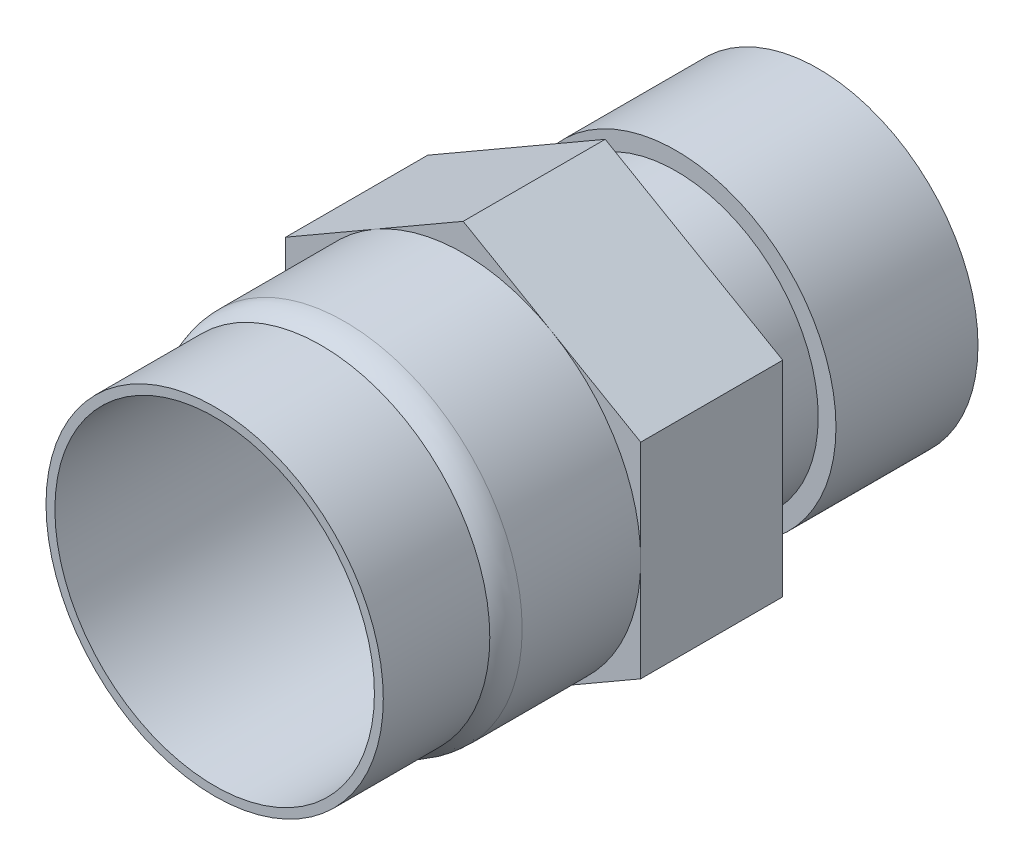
ISO-10303-21;
HEADER;
FILE_DESCRIPTION(('STEP AP214'),'2;1');
FILE_NAME('part.step','',(''),(''),'','','');
FILE_SCHEMA(('AUTOMOTIVE_DESIGN { 1 0 10303 214 1 1 1 1 }'));
ENDSEC;
DATA;
#1=APPLICATION_CONTEXT('core data for automotive mechanical design processes');
#2=APPLICATION_PROTOCOL_DEFINITION('international standard','automotive_design',2000,#1);
#3=PRODUCT_CONTEXT('',#1,'mechanical');
#4=PRODUCT('Part','Part','',(#3));
#5=PRODUCT_RELATED_PRODUCT_CATEGORY('part','',(#4));
#6=PRODUCT_DEFINITION_FORMATION('','',#4);
#7=PRODUCT_DEFINITION_CONTEXT('part definition',#1,'design');
#8=PRODUCT_DEFINITION('design','',#6,#7);
#9=PRODUCT_DEFINITION_SHAPE('','',#8);
#10=(LENGTH_UNIT() NAMED_UNIT(*) SI_UNIT(.MILLI.,.METRE.));
#11=(NAMED_UNIT(*) PLANE_ANGLE_UNIT() SI_UNIT($,.RADIAN.));
#12=(NAMED_UNIT(*) SI_UNIT($,.STERADIAN.) SOLID_ANGLE_UNIT());
#13=UNCERTAINTY_MEASURE_WITH_UNIT(LENGTH_MEASURE(1.E-05),#10,'distance_accuracy_value','');
#14=(GEOMETRIC_REPRESENTATION_CONTEXT(3) GLOBAL_UNCERTAINTY_ASSIGNED_CONTEXT((#13)) GLOBAL_UNIT_ASSIGNED_CONTEXT((#10,
#11,#12)) REPRESENTATION_CONTEXT('',''));
#15=CARTESIAN_POINT('',(0.,0.,0.));
#16=DIRECTION('',(0.,0.,1.));
#17=DIRECTION('',(1.,0.,0.));
#18=AXIS2_PLACEMENT_3D('',#15,#16,#17);
#19=CARTESIAN_POINT('',(-5.,2.88675134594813,-4.));
#20=DIRECTION('',(0.,0.,1.));
#21=DIRECTION('',(1.,0.,0.));
#22=AXIS2_PLACEMENT_3D('',#19,#20,#21);
#23=PLANE('',#22);
#24=CARTESIAN_POINT('',(0.,0.,-4.));
#25=DIRECTION('',(0.,0.,-1.));
#26=DIRECTION('',(-1.,0.,0.));
#27=AXIS2_PLACEMENT_3D('',#24,#25,#26);
#28=CIRCLE('',#27,4.75);
#29=CARTESIAN_POINT('',(-4.75,0.,-4.));
#30=VERTEX_POINT('',#29);
#31=EDGE_CURVE('E218',#30,#30,#28,.T.);
#32=ORIENTED_EDGE('',*,*,#31,.F.);
#33=EDGE_LOOP('',(#32));
#34=FACE_BOUND('',#33,.T.);
#35=DIRECTION('',(0.866025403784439,0.5,0.));
#36=VECTOR('',#35,1.);
#37=CARTESIAN_POINT('',(-5.,2.88675134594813,-4.));
#38=LINE('',#37,#36);
#39=CARTESIAN_POINT('',(-5.,2.88675134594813,-4.));
#40=VERTEX_POINT('',#39);
#41=CARTESIAN_POINT('',(0.,5.77350269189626,-4.));
#42=VERTEX_POINT('',#41);
#43=EDGE_CURVE('E116',#40,#42,#38,.T.);
#44=ORIENTED_EDGE('',*,*,#43,.T.);
#45=DIRECTION('',(0.866025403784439,-0.5,0.));
#46=VECTOR('',#45,1.);
#47=CARTESIAN_POINT('',(0.,5.77350269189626,-4.));
#48=LINE('',#47,#46);
#49=CARTESIAN_POINT('',(5.,2.88675134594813,-4.));
#50=VERTEX_POINT('',#49);
#51=EDGE_CURVE('E106',#42,#50,#48,.T.);
#52=ORIENTED_EDGE('',*,*,#51,.T.);
#53=DIRECTION('',(0.,-1.,0.));
#54=VECTOR('',#53,1.);
#55=CARTESIAN_POINT('',(5.,2.88675134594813,-4.));
#56=LINE('',#55,#54);
#57=CARTESIAN_POINT('',(5.,-2.88675134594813,-4.));
#58=VERTEX_POINT('',#57);
#59=EDGE_CURVE('E115',#50,#58,#56,.T.);
#60=ORIENTED_EDGE('',*,*,#59,.T.);
#61=DIRECTION('',(-0.866025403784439,-0.5,0.));
#62=VECTOR('',#61,1.);
#63=CARTESIAN_POINT('',(5.,-2.88675134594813,-4.));
#64=LINE('',#63,#62);
#65=CARTESIAN_POINT('',(0.,-5.77350269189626,-4.));
#66=VERTEX_POINT('',#65);
#67=EDGE_CURVE('E193',#58,#66,#64,.T.);
#68=ORIENTED_EDGE('',*,*,#67,.T.);
#69=DIRECTION('',(-0.866025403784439,0.5,0.));
#70=VECTOR('',#69,1.);
#71=CARTESIAN_POINT('',(0.,-5.77350269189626,-4.));
#72=LINE('',#71,#70);
#73=CARTESIAN_POINT('',(-5.,-2.88675134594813,-4.));
#74=VERTEX_POINT('',#73);
#75=EDGE_CURVE('E205',#66,#74,#72,.T.);
#76=ORIENTED_EDGE('',*,*,#75,.T.);
#77=DIRECTION('',(0.,1.,0.));
#78=VECTOR('',#77,1.);
#79=CARTESIAN_POINT('',(-5.,-2.88675134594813,-4.));
#80=LINE('',#79,#78);
#81=EDGE_CURVE('E120',#74,#40,#80,.T.);
#82=ORIENTED_EDGE('',*,*,#81,.T.);
#83=EDGE_LOOP('',(#44,#52,#60,#68,#76,#82));
#84=FACE_BOUND('',#83,.T.);
#85=ADVANCED_FACE('F31',(#34,#84),#23,.F.);
#86=CARTESIAN_POINT('',(0.,0.,4.));
#87=DIRECTION('',(0.,0.,-1.));
#88=DIRECTION('',(-1.,0.,0.));
#89=AXIS2_PLACEMENT_3D('',#86,#87,#88);
#90=CYLINDRICAL_SURFACE('',#89,5.);
#91=CARTESIAN_POINT('',(0.,0.,3.33856217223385));
#92=DIRECTION('',(0.,0.,1.));
#93=DIRECTION('',(1.,0.,0.));
#94=AXIS2_PLACEMENT_3D('',#91,#92,#93);
#95=CIRCLE('',#94,5.);
#96=CARTESIAN_POINT('',(5.,0.,3.33856217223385));
#97=VERTEX_POINT('',#96);
#98=EDGE_CURVE('E11',#97,#97,#95,.F.);
#99=ORIENTED_EDGE('',*,*,#98,.T.);
#100=EDGE_LOOP('',(#99));
#101=FACE_BOUND('',#100,.T.);
#102=CARTESIAN_POINT('',(0.,0.,0.));
#103=DIRECTION('',(0.,0.,1.));
#104=DIRECTION('',(1.,0.,0.));
#105=AXIS2_PLACEMENT_3D('',#102,#103,#104);
#106=CIRCLE('',#105,5.);
#107=CARTESIAN_POINT('',(5.,0.,0.));
#108=VERTEX_POINT('',#107);
#109=CARTESIAN_POINT('',(2.5,4.33012701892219,0.));
#110=VERTEX_POINT('',#109);
#111=EDGE_CURVE('E40',#108,#110,#106,.T.);
#112=ORIENTED_EDGE('',*,*,#111,.T.);
#113=CARTESIAN_POINT('',(-2.5,4.3301270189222,0.));
#114=VERTEX_POINT('',#113);
#115=EDGE_CURVE('E55',#110,#114,#106,.T.);
#116=ORIENTED_EDGE('',*,*,#115,.T.);
#117=CARTESIAN_POINT('',(-5.,0.,0.));
#118=VERTEX_POINT('',#117);
#119=EDGE_CURVE('E145',#114,#118,#106,.T.);
#120=ORIENTED_EDGE('',*,*,#119,.T.);
#121=CARTESIAN_POINT('',(-2.5,-4.33012701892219,0.));
#122=VERTEX_POINT('',#121);
#123=EDGE_CURVE('E148',#118,#122,#106,.T.);
#124=ORIENTED_EDGE('',*,*,#123,.T.);
#125=CARTESIAN_POINT('',(2.5,-4.33012701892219,0.));
#126=VERTEX_POINT('',#125);
#127=EDGE_CURVE('E146',#122,#126,#106,.T.);
#128=ORIENTED_EDGE('',*,*,#127,.T.);
#129=EDGE_CURVE('E139',#126,#108,#106,.T.);
#130=ORIENTED_EDGE('',*,*,#129,.T.);
#131=EDGE_LOOP('',(#112,#116,#120,#124,#128,#130));
#132=FACE_BOUND('',#131,.T.);
#133=ADVANCED_FACE('F151',(#101,#132),#90,.T.);
#134=CARTESIAN_POINT('',(0.,0.,7.));
#135=DIRECTION('',(0.,0.,-1.));
#136=DIRECTION('',(-1.,0.,0.));
#137=AXIS2_PLACEMENT_3D('',#134,#135,#136);
#138=CYLINDRICAL_SURFACE('',#137,4.75);
#139=CARTESIAN_POINT('',(0.,0.,7.));
#140=DIRECTION('',(0.,0.,1.));
#141=DIRECTION('',(1.,0.,0.));
#142=AXIS2_PLACEMENT_3D('',#139,#140,#141);
#143=CIRCLE('',#142,4.75);
#144=CARTESIAN_POINT('',(4.75,0.,7.));
#145=VERTEX_POINT('',#144);
#146=EDGE_CURVE('E132',#145,#145,#143,.T.);
#147=ORIENTED_EDGE('',*,*,#146,.F.);
#148=EDGE_LOOP('',(#147));
#149=FACE_BOUND('',#148,.T.);
#150=CARTESIAN_POINT('',(0.,0.,4.));
#151=DIRECTION('',(0.,0.,1.));
#152=DIRECTION('',(1.,0.,0.));
#153=AXIS2_PLACEMENT_3D('',#150,#151,#152);
#154=CIRCLE('',#153,4.75);
#155=CARTESIAN_POINT('',(4.75,0.,4.));
#156=VERTEX_POINT('',#155);
#157=EDGE_CURVE('E129',#156,#156,#154,.T.);
#158=ORIENTED_EDGE('',*,*,#157,.T.);
#159=EDGE_LOOP('',(#158));
#160=FACE_BOUND('',#159,.T.);
#161=ADVANCED_FACE('F257',(#149,#160),#138,.T.);
#162=CARTESIAN_POINT('',(0.,0.,7.));
#163=DIRECTION('',(0.,0.,1.));
#164=DIRECTION('',(1.,0.,0.));
#165=AXIS2_PLACEMENT_3D('',#162,#163,#164);
#166=PLANE('',#165);
#167=CARTESIAN_POINT('',(0.,0.,7.));
#168=DIRECTION('',(0.,0.,1.));
#169=DIRECTION('',(1.,0.,0.));
#170=AXIS2_PLACEMENT_3D('',#167,#168,#169);
#171=CIRCLE('',#170,4.5);
#172=CARTESIAN_POINT('',(4.5,0.,7.));
#173=VERTEX_POINT('',#172);
#174=EDGE_CURVE('E227',#173,#173,#171,.T.);
#175=ORIENTED_EDGE('',*,*,#174,.F.);
#176=EDGE_LOOP('',(#175));
#177=FACE_BOUND('',#176,.T.);
#178=ORIENTED_EDGE('',*,*,#146,.T.);
#179=EDGE_LOOP('',(#178));
#180=FACE_BOUND('',#179,.T.);
#181=ADVANCED_FACE('F253',(#177,#180),#166,.T.);
#182=CARTESIAN_POINT('',(-5.,2.88675134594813,0.));
#183=DIRECTION('',(0.,0.,1.));
#184=DIRECTION('',(1.,0.,0.));
#185=AXIS2_PLACEMENT_3D('',#182,#183,#184);
#186=PLANE('',#185);
#187=ORIENTED_EDGE('',*,*,#111,.F.);
#188=DIRECTION('',(0.,-1.,0.));
#189=VECTOR('',#188,1.);
#190=CARTESIAN_POINT('',(5.,2.88675134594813,0.));
#191=LINE('',#190,#189);
#192=CARTESIAN_POINT('',(5.,2.88675134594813,0.));
#193=VERTEX_POINT('',#192);
#194=EDGE_CURVE('E47',#193,#108,#191,.T.);
#195=ORIENTED_EDGE('',*,*,#194,.F.);
#196=DIRECTION('',(0.866025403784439,-0.5,0.));
#197=VECTOR('',#196,1.);
#198=CARTESIAN_POINT('',(0.,5.77350269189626,0.));
#199=LINE('',#198,#197);
#200=EDGE_CURVE('E164',#110,#193,#199,.T.);
#201=ORIENTED_EDGE('',*,*,#200,.F.);
#202=EDGE_LOOP('',(#187,#195,#201));
#203=FACE_BOUND('',#202,.T.);
#204=ADVANCED_FACE('F256',(#203),#186,.T.);
#205=ORIENTED_EDGE('',*,*,#115,.F.);
#206=CARTESIAN_POINT('',(0.,5.77350269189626,0.));
#207=VERTEX_POINT('',#206);
#208=EDGE_CURVE('E160',#207,#110,#199,.T.);
#209=ORIENTED_EDGE('',*,*,#208,.F.);
#210=DIRECTION('',(0.866025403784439,0.5,0.));
#211=VECTOR('',#210,1.);
#212=CARTESIAN_POINT('',(-5.,2.88675134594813,0.));
#213=LINE('',#212,#211);
#214=EDGE_CURVE('E128',#114,#207,#213,.T.);
#215=ORIENTED_EDGE('',*,*,#214,.F.);
#216=EDGE_LOOP('',(#205,#209,#215));
#217=FACE_BOUND('',#216,.T.);
#218=ADVANCED_FACE('F159',(#217),#186,.T.);
#219=ORIENTED_EDGE('',*,*,#119,.F.);
#220=CARTESIAN_POINT('',(-5.,2.88675134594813,0.));
#221=VERTEX_POINT('',#220);
#222=EDGE_CURVE('E156',#221,#114,#213,.T.);
#223=ORIENTED_EDGE('',*,*,#222,.F.);
#224=DIRECTION('',(0.,1.,0.));
#225=VECTOR('',#224,1.);
#226=CARTESIAN_POINT('',(-5.,-2.88675134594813,0.));
#227=LINE('',#226,#225);
#228=EDGE_CURVE('E157',#118,#221,#227,.T.);
#229=ORIENTED_EDGE('',*,*,#228,.F.);
#230=EDGE_LOOP('',(#219,#223,#229));
#231=FACE_BOUND('',#230,.T.);
#232=ADVANCED_FACE('F155',(#231),#186,.T.);
#233=ORIENTED_EDGE('',*,*,#123,.F.);
#234=CARTESIAN_POINT('',(-5.,-2.88675134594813,0.));
#235=VERTEX_POINT('',#234);
#236=EDGE_CURVE('E124',#235,#118,#227,.T.);
#237=ORIENTED_EDGE('',*,*,#236,.F.);
#238=DIRECTION('',(-0.866025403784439,0.5,0.));
#239=VECTOR('',#238,1.);
#240=CARTESIAN_POINT('',(0.,-5.77350269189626,0.));
#241=LINE('',#240,#239);
#242=EDGE_CURVE('E175',#122,#235,#241,.T.);
#243=ORIENTED_EDGE('',*,*,#242,.F.);
#244=EDGE_LOOP('',(#233,#237,#243));
#245=FACE_BOUND('',#244,.T.);
#246=ADVANCED_FACE('F310',(#245),#186,.T.);
#247=ORIENTED_EDGE('',*,*,#127,.F.);
#248=CARTESIAN_POINT('',(0.,-5.77350269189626,0.));
#249=VERTEX_POINT('',#248);
#250=EDGE_CURVE('E176',#249,#122,#241,.T.);
#251=ORIENTED_EDGE('',*,*,#250,.F.);
#252=DIRECTION('',(-0.866025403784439,-0.5,0.));
#253=VECTOR('',#252,1.);
#254=CARTESIAN_POINT('',(5.,-2.88675134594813,0.));
#255=LINE('',#254,#253);
#256=EDGE_CURVE('E171',#126,#249,#255,.T.);
#257=ORIENTED_EDGE('',*,*,#256,.F.);
#258=EDGE_LOOP('',(#247,#251,#257));
#259=FACE_BOUND('',#258,.T.);
#260=ADVANCED_FACE('F199',(#259),#186,.T.);
#261=ORIENTED_EDGE('',*,*,#129,.F.);
#262=CARTESIAN_POINT('',(5.,-2.88675134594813,0.));
#263=VERTEX_POINT('',#262);
#264=EDGE_CURVE('E172',#263,#126,#255,.T.);
#265=ORIENTED_EDGE('',*,*,#264,.F.);
#266=EDGE_CURVE('E169',#108,#263,#191,.T.);
#267=ORIENTED_EDGE('',*,*,#266,.F.);
#268=EDGE_LOOP('',(#261,#265,#267));
#269=FACE_BOUND('',#268,.T.);
#270=ADVANCED_FACE('F195',(#269),#186,.T.);
#271=CARTESIAN_POINT('',(-5.,2.88675134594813,-4.));
#272=DIRECTION('',(0.5,-0.866025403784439,0.));
#273=DIRECTION('',(0.866025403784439,0.5,0.));
#274=AXIS2_PLACEMENT_3D('',#271,#272,#273);
#275=PLANE('',#274);
#276=ORIENTED_EDGE('',*,*,#222,.T.);
#277=ORIENTED_EDGE('',*,*,#214,.T.);
#278=DIRECTION('',(0.,0.,1.));
#279=VECTOR('',#278,1.);
#280=CARTESIAN_POINT('',(0.,5.77350269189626,-4.));
#281=LINE('',#280,#279);
#282=EDGE_CURVE('E111',#42,#207,#281,.T.);
#283=ORIENTED_EDGE('',*,*,#282,.F.);
#284=ORIENTED_EDGE('',*,*,#43,.F.);
#285=DIRECTION('',(0.,0.,1.));
#286=VECTOR('',#285,1.);
#287=CARTESIAN_POINT('',(-5.,2.88675134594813,-4.));
#288=LINE('',#287,#286);
#289=EDGE_CURVE('E163',#40,#221,#288,.T.);
#290=ORIENTED_EDGE('',*,*,#289,.T.);
#291=EDGE_LOOP('',(#276,#277,#283,#284,#290));
#292=FACE_BOUND('',#291,.T.);
#293=ADVANCED_FACE('F127',(#292),#275,.F.);
#294=CARTESIAN_POINT('',(0.,5.77350269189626,-4.));
#295=DIRECTION('',(-0.5,-0.866025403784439,0.));
#296=DIRECTION('',(0.866025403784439,-0.5,0.));
#297=AXIS2_PLACEMENT_3D('',#294,#295,#296);
#298=PLANE('',#297);
#299=ORIENTED_EDGE('',*,*,#208,.T.);
#300=ORIENTED_EDGE('',*,*,#200,.T.);
#301=DIRECTION('',(0.,0.,1.));
#302=VECTOR('',#301,1.);
#303=CARTESIAN_POINT('',(5.,2.88675134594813,-4.));
#304=LINE('',#303,#302);
#305=EDGE_CURVE('E112',#50,#193,#304,.T.);
#306=ORIENTED_EDGE('',*,*,#305,.F.);
#307=ORIENTED_EDGE('',*,*,#51,.F.);
#308=ORIENTED_EDGE('',*,*,#282,.T.);
#309=EDGE_LOOP('',(#299,#300,#306,#307,#308));
#310=FACE_BOUND('',#309,.T.);
#311=ADVANCED_FACE('F109',(#310),#298,.F.);
#312=CARTESIAN_POINT('',(5.,2.88675134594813,-4.));
#313=DIRECTION('',(-1.,0.,0.));
#314=DIRECTION('',(0.,-1.,0.));
#315=AXIS2_PLACEMENT_3D('',#312,#313,#314);
#316=PLANE('',#315);
#317=ORIENTED_EDGE('',*,*,#194,.T.);
#318=ORIENTED_EDGE('',*,*,#266,.T.);
#319=DIRECTION('',(0.,0.,1.));
#320=VECTOR('',#319,1.);
#321=CARTESIAN_POINT('',(5.,-2.88675134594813,-4.));
#322=LINE('',#321,#320);
#323=EDGE_CURVE('E134',#58,#263,#322,.T.);
#324=ORIENTED_EDGE('',*,*,#323,.F.);
#325=ORIENTED_EDGE('',*,*,#59,.F.);
#326=ORIENTED_EDGE('',*,*,#305,.T.);
#327=EDGE_LOOP('',(#317,#318,#324,#325,#326));
#328=FACE_BOUND('',#327,.T.);
#329=ADVANCED_FACE('F298',(#328),#316,.F.);
#330=CARTESIAN_POINT('',(5.,-2.88675134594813,-4.));
#331=DIRECTION('',(-0.5,0.866025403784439,0.));
#332=DIRECTION('',(-0.866025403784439,-0.5,0.));
#333=AXIS2_PLACEMENT_3D('',#330,#331,#332);
#334=PLANE('',#333);
#335=ORIENTED_EDGE('',*,*,#264,.T.);
#336=ORIENTED_EDGE('',*,*,#256,.T.);
#337=DIRECTION('',(0.,0.,1.));
#338=VECTOR('',#337,1.);
#339=CARTESIAN_POINT('',(0.,-5.77350269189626,-4.));
#340=LINE('',#339,#338);
#341=EDGE_CURVE('E184',#66,#249,#340,.T.);
#342=ORIENTED_EDGE('',*,*,#341,.F.);
#343=ORIENTED_EDGE('',*,*,#67,.F.);
#344=ORIENTED_EDGE('',*,*,#323,.T.);
#345=EDGE_LOOP('',(#335,#336,#342,#343,#344));
#346=FACE_BOUND('',#345,.T.);
#347=ADVANCED_FACE('F191',(#346),#334,.F.);
#348=CARTESIAN_POINT('',(0.,-5.77350269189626,-4.));
#349=DIRECTION('',(0.5,0.866025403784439,0.));
#350=DIRECTION('',(-0.866025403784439,0.5,0.));
#351=AXIS2_PLACEMENT_3D('',#348,#349,#350);
#352=PLANE('',#351);
#353=ORIENTED_EDGE('',*,*,#250,.T.);
#354=ORIENTED_EDGE('',*,*,#242,.T.);
#355=DIRECTION('',(0.,0.,1.));
#356=VECTOR('',#355,1.);
#357=CARTESIAN_POINT('',(-5.,-2.88675134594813,-4.));
#358=LINE('',#357,#356);
#359=EDGE_CURVE('E181',#74,#235,#358,.T.);
#360=ORIENTED_EDGE('',*,*,#359,.F.);
#361=ORIENTED_EDGE('',*,*,#75,.F.);
#362=ORIENTED_EDGE('',*,*,#341,.T.);
#363=EDGE_LOOP('',(#353,#354,#360,#361,#362));
#364=FACE_BOUND('',#363,.T.);
#365=ADVANCED_FACE('F203',(#364),#352,.F.);
#366=CARTESIAN_POINT('',(-5.,-2.88675134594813,-4.));
#367=DIRECTION('',(1.,0.,0.));
#368=DIRECTION('',(0.,1.,0.));
#369=AXIS2_PLACEMENT_3D('',#366,#367,#368);
#370=PLANE('',#369);
#371=ORIENTED_EDGE('',*,*,#236,.T.);
#372=ORIENTED_EDGE('',*,*,#228,.T.);
#373=ORIENTED_EDGE('',*,*,#289,.F.);
#374=ORIENTED_EDGE('',*,*,#81,.F.);
#375=ORIENTED_EDGE('',*,*,#359,.T.);
#376=EDGE_LOOP('',(#371,#372,#373,#374,#375));
#377=FACE_BOUND('',#376,.T.);
#378=ADVANCED_FACE('F289',(#377),#370,.F.);
#379=CARTESIAN_POINT('',(0.,0.,-3.5));
#380=DIRECTION('',(0.,0.,-1.));
#381=DIRECTION('',(-1.,0.,0.));
#382=AXIS2_PLACEMENT_3D('',#379,#380,#381);
#383=CYLINDRICAL_SURFACE('',#382,4.75);
#384=CARTESIAN_POINT('',(0.,0.,-3.5));
#385=DIRECTION('',(0.,0.,-1.));
#386=DIRECTION('',(-1.,0.,0.));
#387=AXIS2_PLACEMENT_3D('',#384,#385,#386);
#388=CIRCLE('',#387,4.75);
#389=CARTESIAN_POINT('',(-4.75,0.,-3.5));
#390=VERTEX_POINT('',#389);
#391=EDGE_CURVE('E215',#390,#390,#388,.T.);
#392=ORIENTED_EDGE('',*,*,#391,.F.);
#393=EDGE_LOOP('',(#392));
#394=FACE_BOUND('',#393,.T.);
#395=ORIENTED_EDGE('',*,*,#31,.T.);
#396=EDGE_LOOP('',(#395));
#397=FACE_BOUND('',#396,.T.);
#398=ADVANCED_FACE('F292',(#394,#397),#383,.F.);
#399=CARTESIAN_POINT('',(0.,0.,-3.5));
#400=DIRECTION('',(0.,0.,-1.));
#401=DIRECTION('',(-1.,0.,0.));
#402=AXIS2_PLACEMENT_3D('',#399,#400,#401);
#403=PLANE('',#402);
#404=CARTESIAN_POINT('',(0.,0.,-3.5));
#405=DIRECTION('',(0.,0.,-1.));
#406=DIRECTION('',(-1.,0.,0.));
#407=AXIS2_PLACEMENT_3D('',#404,#405,#406);
#408=CIRCLE('',#407,4.);
#409=CARTESIAN_POINT('',(-4.,0.,-3.5));
#410=VERTEX_POINT('',#409);
#411=EDGE_CURVE('E221',#410,#410,#408,.T.);
#412=ORIENTED_EDGE('',*,*,#411,.F.);
#413=EDGE_LOOP('',(#412));
#414=FACE_BOUND('',#413,.T.);
#415=ORIENTED_EDGE('',*,*,#391,.T.);
#416=EDGE_LOOP('',(#415));
#417=FACE_BOUND('',#416,.T.);
#418=ADVANCED_FACE('F378',(#414,#417),#403,.T.);
#419=CARTESIAN_POINT('',(0.,0.,-10.));
#420=DIRECTION('',(0.,0.,-1.));
#421=DIRECTION('',(-1.,0.,0.));
#422=AXIS2_PLACEMENT_3D('',#419,#420,#421);
#423=PLANE('',#422);
#424=CARTESIAN_POINT('',(0.,0.,-10.));
#425=DIRECTION('',(0.,0.,-1.));
#426=DIRECTION('',(-1.,0.,0.));
#427=AXIS2_PLACEMENT_3D('',#424,#425,#426);
#428=CIRCLE('',#427,3.25);
#429=CARTESIAN_POINT('',(-3.25,0.,-10.));
#430=VERTEX_POINT('',#429);
#431=EDGE_CURVE('E232',#430,#430,#428,.T.);
#432=ORIENTED_EDGE('',*,*,#431,.F.);
#433=EDGE_LOOP('',(#432));
#434=FACE_BOUND('',#433,.T.);
#435=CARTESIAN_POINT('',(0.,0.,-10.));
#436=DIRECTION('',(0.,0.,-1.));
#437=DIRECTION('',(-1.,0.,0.));
#438=AXIS2_PLACEMENT_3D('',#435,#436,#437);
#439=CIRCLE('',#438,4.5);
#440=CARTESIAN_POINT('',(-4.5,0.,-10.));
#441=VERTEX_POINT('',#440);
#442=EDGE_CURVE('E211',#441,#441,#439,.T.);
#443=ORIENTED_EDGE('',*,*,#442,.T.);
#444=EDGE_LOOP('',(#443));
#445=FACE_BOUND('',#444,.T.);
#446=ADVANCED_FACE('F381',(#434,#445),#423,.T.);
#447=CARTESIAN_POINT('',(0.,0.,-10.));
#448=DIRECTION('',(0.,0.,1.));
#449=DIRECTION('',(1.,0.,0.));
#450=AXIS2_PLACEMENT_3D('',#447,#448,#449);
#451=CYLINDRICAL_SURFACE('',#450,4.5);
#452=ORIENTED_EDGE('',*,*,#442,.F.);
#453=EDGE_LOOP('',(#452));
#454=FACE_BOUND('',#453,.T.);
#455=CARTESIAN_POINT('',(0.,0.,-6.));
#456=DIRECTION('',(0.,0.,-1.));
#457=DIRECTION('',(-1.,0.,0.));
#458=AXIS2_PLACEMENT_3D('',#455,#456,#457);
#459=CIRCLE('',#458,4.5);
#460=CARTESIAN_POINT('',(-4.5,0.,-6.));
#461=VERTEX_POINT('',#460);
#462=EDGE_CURVE('E212',#461,#461,#459,.T.);
#463=ORIENTED_EDGE('',*,*,#462,.T.);
#464=EDGE_LOOP('',(#463));
#465=FACE_BOUND('',#464,.T.);
#466=ADVANCED_FACE('F388',(#454,#465),#451,.T.);
#467=CARTESIAN_POINT('',(0.,0.,-6.));
#468=DIRECTION('',(0.,0.,-1.));
#469=DIRECTION('',(-1.,0.,0.));
#470=AXIS2_PLACEMENT_3D('',#467,#468,#469);
#471=PLANE('',#470);
#472=ORIENTED_EDGE('',*,*,#462,.F.);
#473=EDGE_LOOP('',(#472));
#474=FACE_BOUND('',#473,.T.);
#475=CARTESIAN_POINT('',(0.,0.,-6.));
#476=DIRECTION('',(0.,0.,-1.));
#477=DIRECTION('',(-1.,0.,0.));
#478=AXIS2_PLACEMENT_3D('',#475,#476,#477);
#479=CIRCLE('',#478,4.);
#480=CARTESIAN_POINT('',(-4.,0.,-6.));
#481=VERTEX_POINT('',#480);
#482=EDGE_CURVE('E161',#481,#481,#479,.T.);
#483=ORIENTED_EDGE('',*,*,#482,.T.);
#484=EDGE_LOOP('',(#483));
#485=FACE_BOUND('',#484,.T.);
#486=ADVANCED_FACE('F272',(#474,#485),#471,.F.);
#487=CARTESIAN_POINT('',(0.,0.,-6.));
#488=DIRECTION('',(0.,0.,1.));
#489=DIRECTION('',(1.,0.,0.));
#490=AXIS2_PLACEMENT_3D('',#487,#488,#489);
#491=CYLINDRICAL_SURFACE('',#490,4.);
#492=ORIENTED_EDGE('',*,*,#482,.F.);
#493=EDGE_LOOP('',(#492));
#494=FACE_BOUND('',#493,.T.);
#495=ORIENTED_EDGE('',*,*,#411,.T.);
#496=EDGE_LOOP('',(#495));
#497=FACE_BOUND('',#496,.T.);
#498=ADVANCED_FACE('F267',(#494,#497),#491,.T.);
#499=CARTESIAN_POINT('',(0.,0.,3.33856217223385));
#500=DIRECTION('',(0.,0.,1.));
#501=DIRECTION('',(1.,0.,0.));
#502=AXIS2_PLACEMENT_3D('',#499,#500,#501);
#503=TOROIDAL_SURFACE('',#502,4.,1.);
#504=ORIENTED_EDGE('',*,*,#98,.F.);
#505=EDGE_LOOP('',(#504));
#506=FACE_BOUND('',#505,.T.);
#507=ORIENTED_EDGE('',*,*,#157,.F.);
#508=EDGE_LOOP('',(#507));
#509=FACE_BOUND('',#508,.T.);
#510=ADVANCED_FACE('F33',(#506,#509),#503,.T.);
#511=CARTESIAN_POINT('',(0.,0.,-3.));
#512=DIRECTION('',(0.,0.,1.));
#513=DIRECTION('',(1.,0.,0.));
#514=AXIS2_PLACEMENT_3D('',#511,#512,#513);
#515=CYLINDRICAL_SURFACE('',#514,4.5);
#516=CARTESIAN_POINT('',(0.,0.,-3.));
#517=DIRECTION('',(0.,0.,1.));
#518=DIRECTION('',(1.,0.,0.));
#519=AXIS2_PLACEMENT_3D('',#516,#517,#518);
#520=CIRCLE('',#519,4.5);
#521=CARTESIAN_POINT('',(4.5,0.,-3.));
#522=VERTEX_POINT('',#521);
#523=EDGE_CURVE('E226',#522,#522,#520,.T.);
#524=ORIENTED_EDGE('',*,*,#523,.F.);
#525=EDGE_LOOP('',(#524));
#526=FACE_BOUND('',#525,.T.);
#527=ORIENTED_EDGE('',*,*,#174,.T.);
#528=EDGE_LOOP('',(#527));
#529=FACE_BOUND('',#528,.T.);
#530=ADVANCED_FACE('F244',(#526,#529),#515,.F.);
#531=CARTESIAN_POINT('',(0.,0.,-3.));
#532=DIRECTION('',(0.,0.,1.));
#533=DIRECTION('',(1.,0.,0.));
#534=AXIS2_PLACEMENT_3D('',#531,#532,#533);
#535=PLANE('',#534);
#536=CARTESIAN_POINT('',(0.,0.,-3.));
#537=DIRECTION('',(0.,0.,1.));
#538=DIRECTION('',(1.,0.,0.));
#539=AXIS2_PLACEMENT_3D('',#536,#537,#538);
#540=CIRCLE('',#539,3.25);
#541=CARTESIAN_POINT('',(3.25,0.,-3.));
#542=VERTEX_POINT('',#541);
#543=EDGE_CURVE('E35',#542,#542,#540,.T.);
#544=ORIENTED_EDGE('',*,*,#543,.F.);
#545=EDGE_LOOP('',(#544));
#546=FACE_BOUND('',#545,.T.);
#547=ORIENTED_EDGE('',*,*,#523,.T.);
#548=EDGE_LOOP('',(#547));
#549=FACE_BOUND('',#548,.T.);
#550=ADVANCED_FACE('F241',(#546,#549),#535,.T.);
#551=CARTESIAN_POINT('',(0.,0.,0.));
#552=DIRECTION('',(0.,0.,-1.));
#553=DIRECTION('',(-1.,0.,0.));
#554=AXIS2_PLACEMENT_3D('',#551,#552,#553);
#555=CYLINDRICAL_SURFACE('',#554,3.25);
#556=ORIENTED_EDGE('',*,*,#543,.T.);
#557=EDGE_LOOP('',(#556));
#558=FACE_BOUND('',#557,.T.);
#559=ORIENTED_EDGE('',*,*,#431,.T.);
#560=EDGE_LOOP('',(#559));
#561=FACE_BOUND('',#560,.T.);
#562=ADVANCED_FACE('F239',(#558,#561),#555,.F.);
#563=CLOSED_SHELL('',(#85,#133,#161,#181,#204,#218,#232,#246,#260,#270,#293,#311,#329,#347,#365,
#378,#398,#418,#446,#466,#486,#498,#510,#530,#550,#562));
#564=MANIFOLD_SOLID_BREP('B2',#563);
#565=ADVANCED_BREP_SHAPE_REPRESENTATION('',(#18,#564),#14);
#566=SHAPE_DEFINITION_REPRESENTATION(#9,#565);
ENDSEC;
END-ISO-10303-21;
